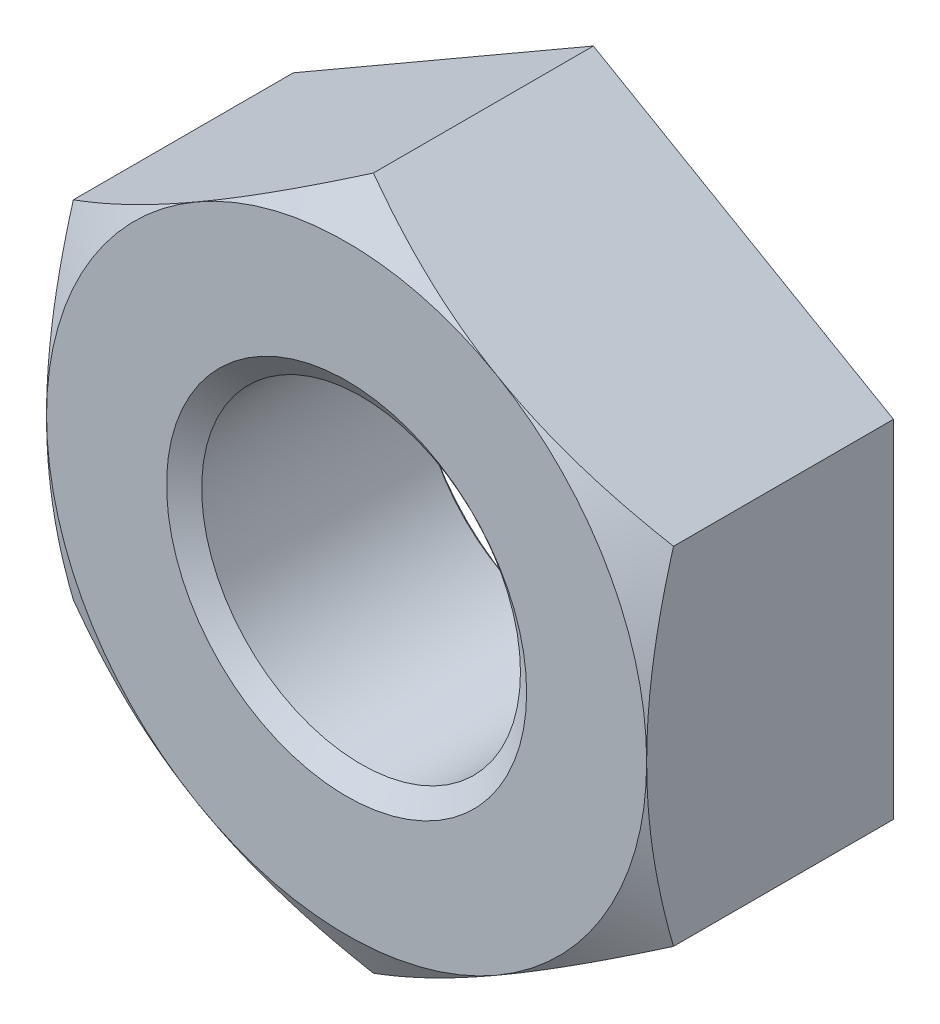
from build123d import *

# Parameters (mm, degrees)
BASENUTSKE_R  = 4.2164
BASENUT_DEPTH = 6.5278


with BuildPart() as part:
    # BaseNutSke → BaseNut (new body)
    with BuildSketch(Plane.XY):
        Polygon((7.9375, 4.582717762), (7.9375, -4.582717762), (0, -9.165435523), (-7.9375, -4.582717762), (-7.9375, 4.582717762), (0, 9.165435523), align=None)
        Circle(BASENUTSKE_R, mode=Mode.SUBTRACT)
    extrude(amount=-BASENUT_DEPTH)

    # Sketch4 → Single-Chamfer (revolve, cut)
    with BuildSketch(Plane(origin=(0, 0, 0), x_dir=(0, 0, -1), z_dir=(1, 0, 0))):
        Polygon((0, 7.9375), (-12.7, 7.9375), (-12.7, 21.865435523), (0.708948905, 21.865435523), (0.708948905, 9.165435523), align=None)
    revolve(axis=Axis((0, 0, 0), (0, 0, -1)), mode=Mode.SUBTRACT)

    # EndChamferSketch → EndChamfer (revolve, cut)
    with BuildSketch(Plane(origin=(0, 0, 0), x_dir=(0, 0, -1), z_dir=(1, 0, 0)), mode=Mode.PRIVATE) as endchamfer_sk:
        Polygon((6.5024, 4.7625), (6.08177833, 4.16179), (6.5532, 4.16179), (6.5532, 4.7625), align=None)
        Polygon((-0.0508, 4.7625), (0, 4.7625), (0.42062167, 4.16179), (-0.0508, 4.16179), align=None)
    revolve(endchamfer_sk.sketch.rotate(Axis((0, 0, -25.037505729), (0, 0, -1)), 90), axis=Axis((0, 0, -25.037505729), (0, 0, -1)), mode=Mode.SUBTRACT)


solid = part.part
